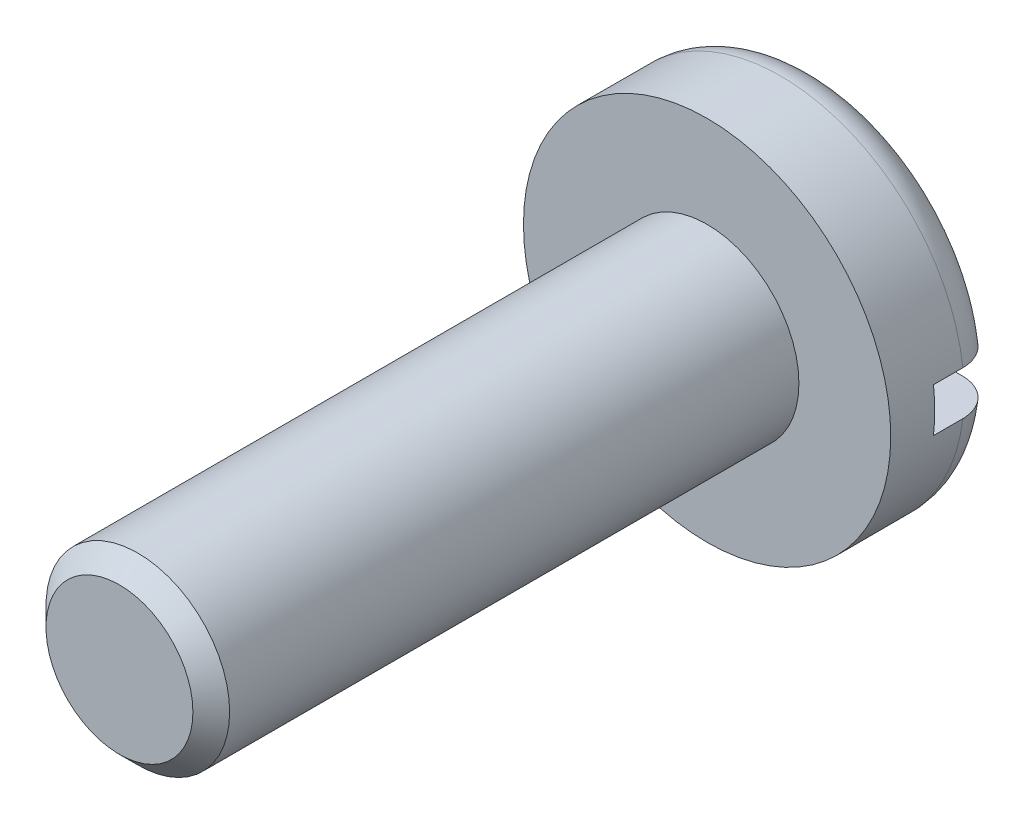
from build123d import *

# Parameters (mm, degrees)
ESQUISSE2_W             = 5
ESQUISSE2_H             = 0.6
ENLEV_MAT_EXTRU_1_DEPTH = 0.9
ESQUISSE3_W             = 1.25
ESQUISSE3_H             = 8
CHANFREIN1_SIZE         = 0.25


with BuildPart() as part:
    # Esquisse1 → Base-R_volution (revolve)
    with BuildSketch(Plane(origin=(0, 0, 0), x_dir=(1, 0, 0), z_dir=(0, 1, 0)), mode=Mode.PRIVATE) as base_r_volution_sk:
        with BuildLine():
            Line((0, 0), (2.5, 0))
            Line((2.5, 0), (2.5, 1))
            ThreePointArc((2.5, 1), (2.353553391, 1.353553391), (2, 1.5))
            Line((2, 1.5), (0, 1.5))
            Line((0, 1.5), (0, 0))
        make_face()
    revolve(base_r_volution_sk.sketch.rotate(Axis((0, 0, 0), (0, 0, -1)), 180), axis=Axis((0, 0, 0), (0, 0, -1)))

    # Esquisse2 → Enlev. mat.-Extru.1 (cut)
    with BuildSketch(Plane.XY.offset(-1.5)):
        Rectangle(ESQUISSE2_W, ESQUISSE2_H)
    extrude(amount=ENLEV_MAT_EXTRU_1_DEPTH, mode=Mode.SUBTRACT)

    # Esquisse3 → Boss.-R_vol.1 (revolve)
    with BuildSketch(Plane(origin=(0, 0, 0), x_dir=(1, 0, 0), z_dir=(0, 1, 0))):
        with Locations((0.625, -4)):
            Rectangle(ESQUISSE3_W, ESQUISSE3_H)
    revolve(axis=Axis((0, 0, 0), (0, 0, 1)))

    # Chanfrein1
    chanfrein1_edges = [part.edges().sort_by_distance(p)[0] for p in [
        (-1.25, 0, 8),
    ]]
    chamfer(chanfrein1_edges, length=CHANFREIN1_SIZE)


solid = part.part
